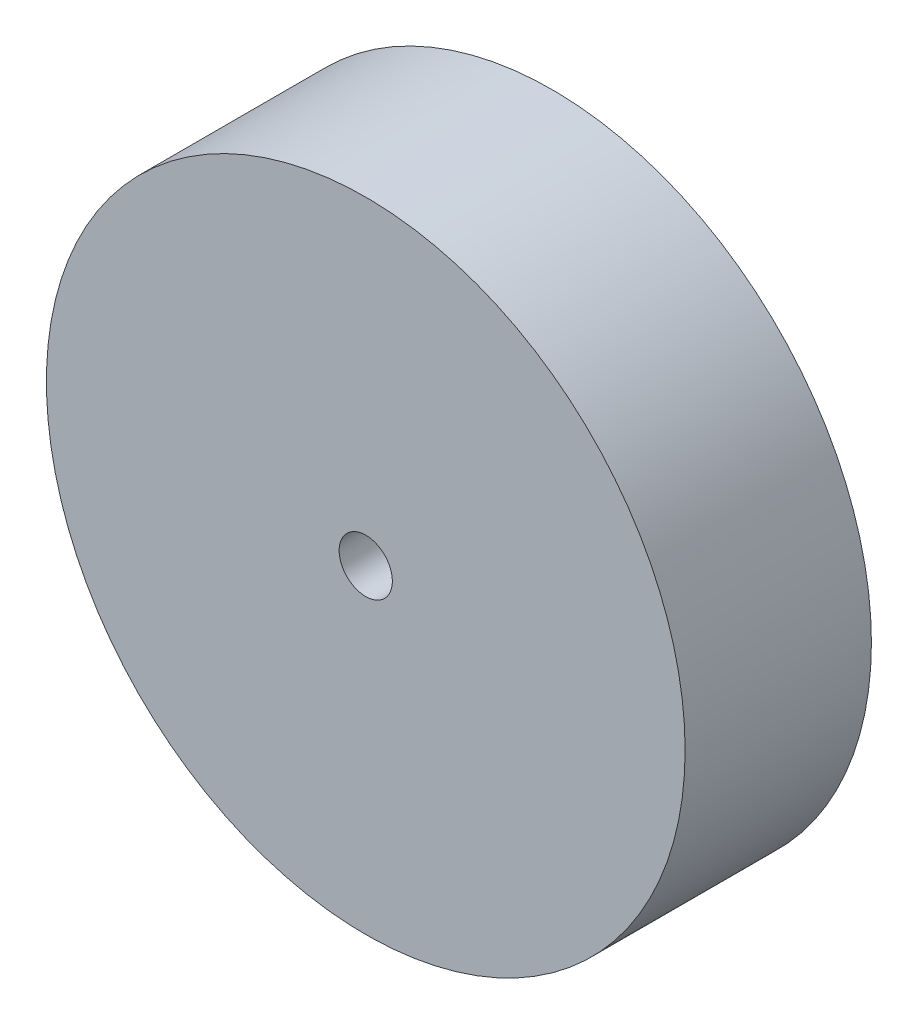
from build123d import *

# Parameters (mm, degrees)
SKETCH1_R           = 38.1
BOSS_EXTRUDE1_DEPTH = 22.225
SKETCH2_R           = 3.175
CUT_EXTRUDE1_DEPTH  = 59.285252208


with BuildPart() as part:
    # Sketch1 → Boss-Extrude1 (new body)
    with BuildSketch(Plane.XY):
        Circle(SKETCH1_R)
    extrude(amount=BOSS_EXTRUDE1_DEPTH)

    # Sketch2 → Cut-Extrude1 (cut, through all)
    with BuildSketch(Plane.XY.offset(22.225)):
        Circle(SKETCH2_R)
    extrude(amount=-CUT_EXTRUDE1_DEPTH, mode=Mode.SUBTRACT)


solid = part.part
